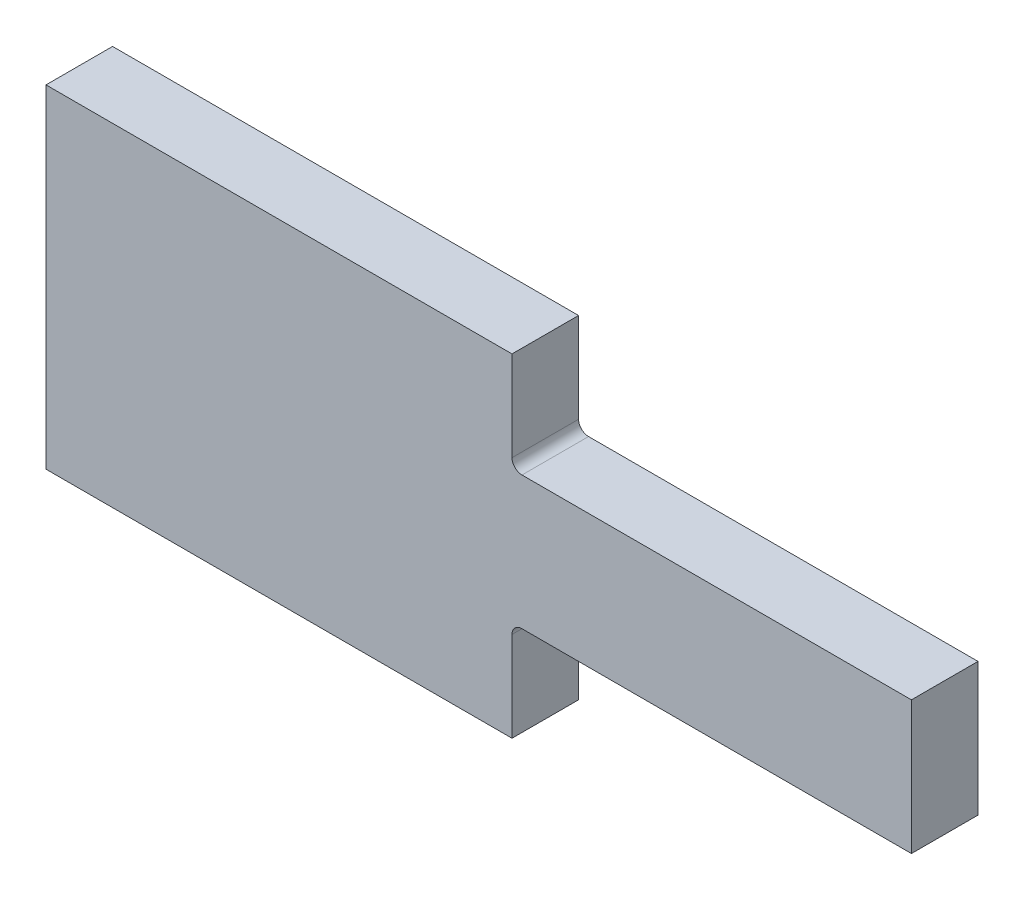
ISO-10303-21;
HEADER;
FILE_DESCRIPTION(('STEP AP214'),'2;1');
FILE_NAME('part.step','',(''),(''),'','','');
FILE_SCHEMA(('AUTOMOTIVE_DESIGN { 1 0 10303 214 1 1 1 1 }'));
ENDSEC;
DATA;
#1=APPLICATION_CONTEXT('core data for automotive mechanical design processes');
#2=APPLICATION_PROTOCOL_DEFINITION('international standard','automotive_design',2000,#1);
#3=PRODUCT_CONTEXT('',#1,'mechanical');
#4=PRODUCT('Part','Part','',(#3));
#5=PRODUCT_RELATED_PRODUCT_CATEGORY('part','',(#4));
#6=PRODUCT_DEFINITION_FORMATION('','',#4);
#7=PRODUCT_DEFINITION_CONTEXT('part definition',#1,'design');
#8=PRODUCT_DEFINITION('design','',#6,#7);
#9=PRODUCT_DEFINITION_SHAPE('','',#8);
#10=(LENGTH_UNIT() NAMED_UNIT(*) SI_UNIT(.MILLI.,.METRE.));
#11=(NAMED_UNIT(*) PLANE_ANGLE_UNIT() SI_UNIT($,.RADIAN.));
#12=(NAMED_UNIT(*) SI_UNIT($,.STERADIAN.) SOLID_ANGLE_UNIT());
#13=UNCERTAINTY_MEASURE_WITH_UNIT(LENGTH_MEASURE(1.E-05),#10,'distance_accuracy_value','');
#14=(GEOMETRIC_REPRESENTATION_CONTEXT(3) GLOBAL_UNCERTAINTY_ASSIGNED_CONTEXT((#13)) GLOBAL_UNIT_ASSIGNED_CONTEXT((#10,
#11,#12)) REPRESENTATION_CONTEXT('',''));
#15=CARTESIAN_POINT('',(0.,0.,0.));
#16=DIRECTION('',(0.,0.,1.));
#17=DIRECTION('',(1.,0.,0.));
#18=AXIS2_PLACEMENT_3D('',#15,#16,#17);
#19=CARTESIAN_POINT('',(140.,-50.,20.));
#20=DIRECTION('',(0.,1.,0.));
#21=DIRECTION('',(0.,0.,1.));
#22=AXIS2_PLACEMENT_3D('',#19,#20,#21);
#23=PLANE('',#22);
#24=DIRECTION('',(1.,0.,0.));
#25=VECTOR('',#24,1.);
#26=CARTESIAN_POINT('',(140.,-50.,0.));
#27=LINE('',#26,#25);
#28=CARTESIAN_POINT('',(0.,-50.,0.));
#29=VERTEX_POINT('',#28);
#30=CARTESIAN_POINT('',(140.,-50.,0.));
#31=VERTEX_POINT('',#30);
#32=EDGE_CURVE('E133',#29,#31,#27,.T.);
#33=ORIENTED_EDGE('',*,*,#32,.T.);
#34=DIRECTION('',(0.,0.,-1.));
#35=VECTOR('',#34,1.);
#36=CARTESIAN_POINT('',(140.,-50.,20.));
#37=LINE('',#36,#35);
#38=CARTESIAN_POINT('',(140.,-50.,20.));
#39=VERTEX_POINT('',#38);
#40=EDGE_CURVE('E114',#39,#31,#37,.T.);
#41=ORIENTED_EDGE('',*,*,#40,.F.);
#42=DIRECTION('',(1.,0.,0.));
#43=VECTOR('',#42,1.);
#44=CARTESIAN_POINT('',(140.,-50.,20.));
#45=LINE('',#44,#43);
#46=CARTESIAN_POINT('',(0.,-50.,20.));
#47=VERTEX_POINT('',#46);
#48=EDGE_CURVE('E121',#47,#39,#45,.T.);
#49=ORIENTED_EDGE('',*,*,#48,.F.);
#50=DIRECTION('',(0.,0.,-1.));
#51=VECTOR('',#50,1.);
#52=CARTESIAN_POINT('',(0.,-50.,20.));
#53=LINE('',#52,#51);
#54=EDGE_CURVE('E181',#47,#29,#53,.T.);
#55=ORIENTED_EDGE('',*,*,#54,.T.);
#56=EDGE_LOOP('',(#33,#41,#49,#55));
#57=FACE_BOUND('',#56,.T.);
#58=ADVANCED_FACE('F32',(#57),#23,.F.);
#59=CARTESIAN_POINT('',(140.,-20.,20.));
#60=DIRECTION('',(-1.,0.,0.));
#61=DIRECTION('',(0.,0.,1.));
#62=AXIS2_PLACEMENT_3D('',#59,#60,#61);
#63=PLANE('',#62);
#64=DIRECTION('',(0.,1.,0.));
#65=VECTOR('',#64,1.);
#66=CARTESIAN_POINT('',(140.,-20.,0.));
#67=LINE('',#66,#65);
#68=CARTESIAN_POINT('',(140.,-23.,0.));
#69=VERTEX_POINT('',#68);
#70=EDGE_CURVE('E164',#31,#69,#67,.T.);
#71=ORIENTED_EDGE('',*,*,#70,.T.);
#72=DIRECTION('',(0.,0.,-1.));
#73=VECTOR('',#72,1.);
#74=CARTESIAN_POINT('',(140.,-23.,20.));
#75=LINE('',#74,#73);
#76=CARTESIAN_POINT('',(140.,-23.,20.));
#77=VERTEX_POINT('',#76);
#78=EDGE_CURVE('E117',#69,#77,#75,.F.);
#79=ORIENTED_EDGE('',*,*,#78,.T.);
#80=DIRECTION('',(0.,1.,0.));
#81=VECTOR('',#80,1.);
#82=CARTESIAN_POINT('',(140.,-20.,20.));
#83=LINE('',#82,#81);
#84=EDGE_CURVE('E109',#39,#77,#83,.T.);
#85=ORIENTED_EDGE('',*,*,#84,.F.);
#86=ORIENTED_EDGE('',*,*,#40,.T.);
#87=EDGE_LOOP('',(#71,#79,#85,#86));
#88=FACE_BOUND('',#87,.T.);
#89=ADVANCED_FACE('F112',(#88),#63,.F.);
#90=CARTESIAN_POINT('',(260.,-20.,20.));
#91=DIRECTION('',(0.,1.,0.));
#92=DIRECTION('',(-1.,0.,0.));
#93=AXIS2_PLACEMENT_3D('',#90,#91,#92);
#94=PLANE('',#93);
#95=DIRECTION('',(1.,0.,0.));
#96=VECTOR('',#95,1.);
#97=CARTESIAN_POINT('',(260.,-20.,20.));
#98=LINE('',#97,#96);
#99=CARTESIAN_POINT('',(143.,-20.,20.));
#100=VERTEX_POINT('',#99);
#101=CARTESIAN_POINT('',(260.,-20.,20.));
#102=VERTEX_POINT('',#101);
#103=EDGE_CURVE('E120',#100,#102,#98,.T.);
#104=ORIENTED_EDGE('',*,*,#103,.F.);
#105=DIRECTION('',(0.,0.,-1.));
#106=VECTOR('',#105,1.);
#107=CARTESIAN_POINT('',(143.,-20.,0.));
#108=LINE('',#107,#106);
#109=CARTESIAN_POINT('',(143.,-20.,0.));
#110=VERTEX_POINT('',#109);
#111=EDGE_CURVE('E134',#100,#110,#108,.T.);
#112=ORIENTED_EDGE('',*,*,#111,.T.);
#113=DIRECTION('',(1.,0.,0.));
#114=VECTOR('',#113,1.);
#115=CARTESIAN_POINT('',(260.,-20.,0.));
#116=LINE('',#115,#114);
#117=CARTESIAN_POINT('',(260.,-20.,0.));
#118=VERTEX_POINT('',#117);
#119=EDGE_CURVE('E166',#110,#118,#116,.T.);
#120=ORIENTED_EDGE('',*,*,#119,.T.);
#121=DIRECTION('',(0.,0.,-1.));
#122=VECTOR('',#121,1.);
#123=CARTESIAN_POINT('',(260.,-20.,20.));
#124=LINE('',#123,#122);
#125=EDGE_CURVE('E135',#102,#118,#124,.T.);
#126=ORIENTED_EDGE('',*,*,#125,.F.);
#127=EDGE_LOOP('',(#104,#112,#120,#126));
#128=FACE_BOUND('',#127,.T.);
#129=ADVANCED_FACE('F157',(#128),#94,.F.);
#130=CARTESIAN_POINT('',(260.,20.,20.));
#131=DIRECTION('',(-1.,0.,0.));
#132=DIRECTION('',(0.,0.,1.));
#133=AXIS2_PLACEMENT_3D('',#130,#131,#132);
#134=PLANE('',#133);
#135=DIRECTION('',(0.,1.,0.));
#136=VECTOR('',#135,1.);
#137=CARTESIAN_POINT('',(260.,20.,0.));
#138=LINE('',#137,#136);
#139=CARTESIAN_POINT('',(260.,20.,0.));
#140=VERTEX_POINT('',#139);
#141=EDGE_CURVE('E168',#118,#140,#138,.T.);
#142=ORIENTED_EDGE('',*,*,#141,.T.);
#143=DIRECTION('',(0.,0.,-1.));
#144=VECTOR('',#143,1.);
#145=CARTESIAN_POINT('',(260.,20.,20.));
#146=LINE('',#145,#144);
#147=CARTESIAN_POINT('',(260.,20.,20.));
#148=VERTEX_POINT('',#147);
#149=EDGE_CURVE('E140',#148,#140,#146,.T.);
#150=ORIENTED_EDGE('',*,*,#149,.F.);
#151=DIRECTION('',(0.,1.,0.));
#152=VECTOR('',#151,1.);
#153=CARTESIAN_POINT('',(260.,20.,20.));
#154=LINE('',#153,#152);
#155=EDGE_CURVE('E160',#102,#148,#154,.T.);
#156=ORIENTED_EDGE('',*,*,#155,.F.);
#157=ORIENTED_EDGE('',*,*,#125,.T.);
#158=EDGE_LOOP('',(#142,#150,#156,#157));
#159=FACE_BOUND('',#158,.T.);
#160=ADVANCED_FACE('F193',(#159),#134,.F.);
#161=CARTESIAN_POINT('',(140.,20.,20.));
#162=DIRECTION('',(0.,-1.,0.));
#163=DIRECTION('',(1.,0.,0.));
#164=AXIS2_PLACEMENT_3D('',#161,#162,#163);
#165=PLANE('',#164);
#166=DIRECTION('',(-1.,0.,0.));
#167=VECTOR('',#166,1.);
#168=CARTESIAN_POINT('',(140.,20.,0.));
#169=LINE('',#168,#167);
#170=CARTESIAN_POINT('',(143.,20.,0.));
#171=VERTEX_POINT('',#170);
#172=EDGE_CURVE('E174',#140,#171,#169,.T.);
#173=ORIENTED_EDGE('',*,*,#172,.T.);
#174=DIRECTION('',(0.,0.,-1.));
#175=VECTOR('',#174,1.);
#176=CARTESIAN_POINT('',(143.,20.,20.));
#177=LINE('',#176,#175);
#178=CARTESIAN_POINT('',(143.,20.,20.));
#179=VERTEX_POINT('',#178);
#180=EDGE_CURVE('E47',#171,#179,#177,.F.);
#181=ORIENTED_EDGE('',*,*,#180,.T.);
#182=DIRECTION('',(-1.,0.,0.));
#183=VECTOR('',#182,1.);
#184=CARTESIAN_POINT('',(140.,20.,20.));
#185=LINE('',#184,#183);
#186=EDGE_CURVE('E191',#148,#179,#185,.T.);
#187=ORIENTED_EDGE('',*,*,#186,.F.);
#188=ORIENTED_EDGE('',*,*,#149,.T.);
#189=EDGE_LOOP('',(#173,#181,#187,#188));
#190=FACE_BOUND('',#189,.T.);
#191=ADVANCED_FACE('F190',(#190),#165,.F.);
#192=CARTESIAN_POINT('',(140.,50.,20.));
#193=DIRECTION('',(-1.,0.,0.));
#194=DIRECTION('',(0.,0.,1.));
#195=AXIS2_PLACEMENT_3D('',#192,#193,#194);
#196=PLANE('',#195);
#197=DIRECTION('',(0.,1.,0.));
#198=VECTOR('',#197,1.);
#199=CARTESIAN_POINT('',(140.,50.,20.));
#200=LINE('',#199,#198);
#201=CARTESIAN_POINT('',(140.,23.,20.));
#202=VERTEX_POINT('',#201);
#203=CARTESIAN_POINT('',(140.,50.,20.));
#204=VERTEX_POINT('',#203);
#205=EDGE_CURVE('E195',#202,#204,#200,.T.);
#206=ORIENTED_EDGE('',*,*,#205,.F.);
#207=DIRECTION('',(0.,0.,-1.));
#208=VECTOR('',#207,1.);
#209=CARTESIAN_POINT('',(140.,23.,0.));
#210=LINE('',#209,#208);
#211=CARTESIAN_POINT('',(140.,23.,0.));
#212=VERTEX_POINT('',#211);
#213=EDGE_CURVE('E145',#202,#212,#210,.T.);
#214=ORIENTED_EDGE('',*,*,#213,.T.);
#215=DIRECTION('',(0.,1.,0.));
#216=VECTOR('',#215,1.);
#217=CARTESIAN_POINT('',(140.,50.,0.));
#218=LINE('',#217,#216);
#219=CARTESIAN_POINT('',(140.,50.,0.));
#220=VERTEX_POINT('',#219);
#221=EDGE_CURVE('E176',#212,#220,#218,.T.);
#222=ORIENTED_EDGE('',*,*,#221,.T.);
#223=DIRECTION('',(0.,0.,-1.));
#224=VECTOR('',#223,1.);
#225=CARTESIAN_POINT('',(140.,50.,20.));
#226=LINE('',#225,#224);
#227=EDGE_CURVE('E186',#204,#220,#226,.T.);
#228=ORIENTED_EDGE('',*,*,#227,.F.);
#229=EDGE_LOOP('',(#206,#214,#222,#228));
#230=FACE_BOUND('',#229,.T.);
#231=ADVANCED_FACE('F211',(#230),#196,.F.);
#232=CARTESIAN_POINT('',(0.,50.,20.));
#233=DIRECTION('',(0.,-1.,0.));
#234=DIRECTION('',(0.,0.,-1.));
#235=AXIS2_PLACEMENT_3D('',#232,#233,#234);
#236=PLANE('',#235);
#237=DIRECTION('',(-1.,0.,0.));
#238=VECTOR('',#237,1.);
#239=CARTESIAN_POINT('',(0.,50.,0.));
#240=LINE('',#239,#238);
#241=CARTESIAN_POINT('',(0.,50.,0.));
#242=VERTEX_POINT('',#241);
#243=EDGE_CURVE('E178',#220,#242,#240,.T.);
#244=ORIENTED_EDGE('',*,*,#243,.T.);
#245=DIRECTION('',(0.,0.,-1.));
#246=VECTOR('',#245,1.);
#247=CARTESIAN_POINT('',(0.,50.,20.));
#248=LINE('',#247,#246);
#249=CARTESIAN_POINT('',(0.,50.,20.));
#250=VERTEX_POINT('',#249);
#251=EDGE_CURVE('E183',#250,#242,#248,.T.);
#252=ORIENTED_EDGE('',*,*,#251,.F.);
#253=DIRECTION('',(-1.,0.,0.));
#254=VECTOR('',#253,1.);
#255=CARTESIAN_POINT('',(0.,50.,20.));
#256=LINE('',#255,#254);
#257=EDGE_CURVE('E199',#204,#250,#256,.T.);
#258=ORIENTED_EDGE('',*,*,#257,.F.);
#259=ORIENTED_EDGE('',*,*,#227,.T.);
#260=EDGE_LOOP('',(#244,#252,#258,#259));
#261=FACE_BOUND('',#260,.T.);
#262=ADVANCED_FACE('F205',(#261),#236,.F.);
#263=CARTESIAN_POINT('',(0.,-50.,20.));
#264=DIRECTION('',(1.,0.,0.));
#265=DIRECTION('',(0.,0.,-1.));
#266=AXIS2_PLACEMENT_3D('',#263,#264,#265);
#267=PLANE('',#266);
#268=DIRECTION('',(0.,-1.,0.));
#269=VECTOR('',#268,1.);
#270=CARTESIAN_POINT('',(0.,-50.,0.));
#271=LINE('',#270,#269);
#272=EDGE_CURVE('E130',#242,#29,#271,.T.);
#273=ORIENTED_EDGE('',*,*,#272,.T.);
#274=ORIENTED_EDGE('',*,*,#54,.F.);
#275=DIRECTION('',(0.,-1.,0.));
#276=VECTOR('',#275,1.);
#277=CARTESIAN_POINT('',(0.,-50.,20.));
#278=LINE('',#277,#276);
#279=EDGE_CURVE('E126',#250,#47,#278,.T.);
#280=ORIENTED_EDGE('',*,*,#279,.F.);
#281=ORIENTED_EDGE('',*,*,#251,.T.);
#282=EDGE_LOOP('',(#273,#274,#280,#281));
#283=FACE_BOUND('',#282,.T.);
#284=ADVANCED_FACE('F209',(#283),#267,.F.);
#285=CARTESIAN_POINT('',(0.,0.,20.));
#286=DIRECTION('',(0.,0.,-1.));
#287=DIRECTION('',(-1.,0.,0.));
#288=AXIS2_PLACEMENT_3D('',#285,#286,#287);
#289=PLANE('',#288);
#290=ORIENTED_EDGE('',*,*,#48,.T.);
#291=ORIENTED_EDGE('',*,*,#84,.T.);
#292=CARTESIAN_POINT('',(143.,-23.,20.));
#293=DIRECTION('',(0.,0.,-1.));
#294=DIRECTION('',(-1.,0.,0.));
#295=AXIS2_PLACEMENT_3D('',#292,#293,#294);
#296=CIRCLE('',#295,3.);
#297=EDGE_CURVE('E151',#77,#100,#296,.T.);
#298=ORIENTED_EDGE('',*,*,#297,.T.);
#299=ORIENTED_EDGE('',*,*,#103,.T.);
#300=ORIENTED_EDGE('',*,*,#155,.T.);
#301=ORIENTED_EDGE('',*,*,#186,.T.);
#302=CARTESIAN_POINT('',(143.,23.,20.));
#303=DIRECTION('',(0.,0.,-1.));
#304=DIRECTION('',(-1.,0.,0.));
#305=AXIS2_PLACEMENT_3D('',#302,#303,#304);
#306=CIRCLE('',#305,3.);
#307=EDGE_CURVE('E11',#179,#202,#306,.T.);
#308=ORIENTED_EDGE('',*,*,#307,.T.);
#309=ORIENTED_EDGE('',*,*,#205,.T.);
#310=ORIENTED_EDGE('',*,*,#257,.T.);
#311=ORIENTED_EDGE('',*,*,#279,.T.);
#312=EDGE_LOOP('',(#290,#291,#298,#299,#300,#301,#308,#309,#310,#311));
#313=FACE_BOUND('',#312,.T.);
#314=ADVANCED_FACE('F124',(#313),#289,.F.);
#315=CARTESIAN_POINT('',(0.,0.,0.));
#316=DIRECTION('',(0.,0.,-1.));
#317=DIRECTION('',(-1.,0.,0.));
#318=AXIS2_PLACEMENT_3D('',#315,#316,#317);
#319=PLANE('',#318);
#320=ORIENTED_EDGE('',*,*,#32,.F.);
#321=ORIENTED_EDGE('',*,*,#272,.F.);
#322=ORIENTED_EDGE('',*,*,#243,.F.);
#323=ORIENTED_EDGE('',*,*,#221,.F.);
#324=CARTESIAN_POINT('',(143.,23.,0.));
#325=DIRECTION('',(0.,0.,-1.));
#326=DIRECTION('',(-1.,0.,0.));
#327=AXIS2_PLACEMENT_3D('',#324,#325,#326);
#328=CIRCLE('',#327,3.);
#329=EDGE_CURVE('E40',#212,#171,#328,.F.);
#330=ORIENTED_EDGE('',*,*,#329,.T.);
#331=ORIENTED_EDGE('',*,*,#172,.F.);
#332=ORIENTED_EDGE('',*,*,#141,.F.);
#333=ORIENTED_EDGE('',*,*,#119,.F.);
#334=CARTESIAN_POINT('',(143.,-23.,0.));
#335=DIRECTION('',(0.,0.,-1.));
#336=DIRECTION('',(-1.,0.,0.));
#337=AXIS2_PLACEMENT_3D('',#334,#335,#336);
#338=CIRCLE('',#337,3.);
#339=EDGE_CURVE('E149',#110,#69,#338,.F.);
#340=ORIENTED_EDGE('',*,*,#339,.T.);
#341=ORIENTED_EDGE('',*,*,#70,.F.);
#342=EDGE_LOOP('',(#320,#321,#322,#323,#330,#331,#332,#333,#340,#341));
#343=FACE_BOUND('',#342,.T.);
#344=ADVANCED_FACE('F163',(#343),#319,.T.);
#345=CARTESIAN_POINT('',(143.,-23.,20.));
#346=DIRECTION('',(0.,0.,1.));
#347=DIRECTION('',(1.,0.,0.));
#348=AXIS2_PLACEMENT_3D('',#345,#346,#347);
#349=CYLINDRICAL_SURFACE('',#348,3.);
#350=ORIENTED_EDGE('',*,*,#297,.F.);
#351=ORIENTED_EDGE('',*,*,#78,.F.);
#352=ORIENTED_EDGE('',*,*,#339,.F.);
#353=ORIENTED_EDGE('',*,*,#111,.F.);
#354=EDGE_LOOP('',(#350,#351,#352,#353));
#355=FACE_BOUND('',#354,.T.);
#356=ADVANCED_FACE('F162',(#355),#349,.F.);
#357=CARTESIAN_POINT('',(143.,23.,20.));
#358=DIRECTION('',(0.,0.,1.));
#359=DIRECTION('',(1.,0.,0.));
#360=AXIS2_PLACEMENT_3D('',#357,#358,#359);
#361=CYLINDRICAL_SURFACE('',#360,3.);
#362=ORIENTED_EDGE('',*,*,#307,.F.);
#363=ORIENTED_EDGE('',*,*,#180,.F.);
#364=ORIENTED_EDGE('',*,*,#329,.F.);
#365=ORIENTED_EDGE('',*,*,#213,.F.);
#366=EDGE_LOOP('',(#362,#363,#364,#365));
#367=FACE_BOUND('',#366,.T.);
#368=ADVANCED_FACE('F34',(#367),#361,.F.);
#369=CLOSED_SHELL('',(#58,#89,#129,#160,#191,#231,#262,#284,#314,#344,#356,#368));
#370=MANIFOLD_SOLID_BREP('B2',#369);
#371=ADVANCED_BREP_SHAPE_REPRESENTATION('',(#18,#370),#14);
#372=SHAPE_DEFINITION_REPRESENTATION(#9,#371);
ENDSEC;
END-ISO-10303-21;
